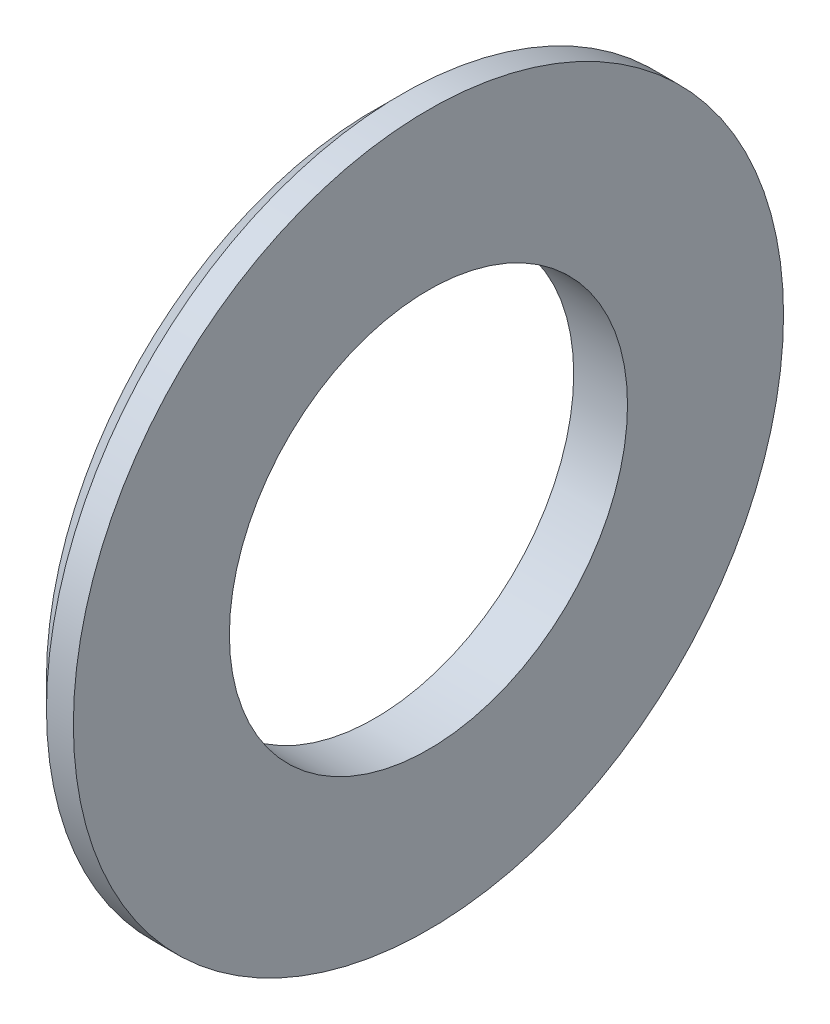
ISO-10303-21;
HEADER;
FILE_DESCRIPTION(('STEP AP214'),'2;1');
FILE_NAME('part.step','',(''),(''),'','','');
FILE_SCHEMA(('AUTOMOTIVE_DESIGN { 1 0 10303 214 1 1 1 1 }'));
ENDSEC;
DATA;
#1=APPLICATION_CONTEXT('core data for automotive mechanical design processes');
#2=APPLICATION_PROTOCOL_DEFINITION('international standard','automotive_design',2000,#1);
#3=PRODUCT_CONTEXT('',#1,'mechanical');
#4=PRODUCT('Part','Part','',(#3));
#5=PRODUCT_RELATED_PRODUCT_CATEGORY('part','',(#4));
#6=PRODUCT_DEFINITION_FORMATION('','',#4);
#7=PRODUCT_DEFINITION_CONTEXT('part definition',#1,'design');
#8=PRODUCT_DEFINITION('design','',#6,#7);
#9=PRODUCT_DEFINITION_SHAPE('','',#8);
#10=(LENGTH_UNIT() NAMED_UNIT(*) SI_UNIT(.MILLI.,.METRE.));
#11=(NAMED_UNIT(*) PLANE_ANGLE_UNIT() SI_UNIT($,.RADIAN.));
#12=(NAMED_UNIT(*) SI_UNIT($,.STERADIAN.) SOLID_ANGLE_UNIT());
#13=UNCERTAINTY_MEASURE_WITH_UNIT(LENGTH_MEASURE(1.E-05),#10,'distance_accuracy_value','');
#14=(GEOMETRIC_REPRESENTATION_CONTEXT(3) GLOBAL_UNCERTAINTY_ASSIGNED_CONTEXT((#13)) GLOBAL_UNIT_ASSIGNED_CONTEXT((#10,
#11,#12)) REPRESENTATION_CONTEXT('',''));
#15=CARTESIAN_POINT('',(0.,0.,0.));
#16=DIRECTION('',(0.,0.,1.));
#17=DIRECTION('',(1.,0.,0.));
#18=AXIS2_PLACEMENT_3D('',#15,#16,#17);
#19=CARTESIAN_POINT('',(-34.9249999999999,0.,0.));
#20=DIRECTION('',(-1.,0.,0.));
#21=DIRECTION('',(0.,0.,1.));
#22=AXIS2_PLACEMENT_3D('',#19,#20,#21);
#23=CYLINDRICAL_SURFACE('',#22,18.5);
#24=CARTESIAN_POINT('',(0.,0.,0.));
#25=DIRECTION('',(-1.,0.,0.));
#26=DIRECTION('',(0.,0.,1.));
#27=AXIS2_PLACEMENT_3D('',#24,#25,#26);
#28=CIRCLE('',#27,18.5);
#29=CARTESIAN_POINT('',(0.,0.,18.5));
#30=VERTEX_POINT('',#29);
#31=EDGE_CURVE('E10',#30,#30,#28,.T.);
#32=ORIENTED_EDGE('',*,*,#31,.F.);
#33=EDGE_LOOP('',(#32));
#34=FACE_BOUND('',#33,.T.);
#35=CARTESIAN_POINT('',(-5.,0.,0.));
#36=DIRECTION('',(-1.,0.,0.));
#37=DIRECTION('',(0.,0.,1.));
#38=AXIS2_PLACEMENT_3D('',#35,#36,#37);
#39=CIRCLE('',#38,18.5);
#40=CARTESIAN_POINT('',(-5.,0.,18.5));
#41=VERTEX_POINT('',#40);
#42=EDGE_CURVE('E50',#41,#41,#39,.T.);
#43=ORIENTED_EDGE('',*,*,#42,.T.);
#44=EDGE_LOOP('',(#43));
#45=FACE_BOUND('',#44,.T.);
#46=ADVANCED_FACE('F31',(#34,#45),#23,.F.);
#47=CARTESIAN_POINT('',(0.,18.5,0.));
#48=DIRECTION('',(-1.,0.,0.));
#49=DIRECTION('',(0.,0.,1.));
#50=AXIS2_PLACEMENT_3D('',#47,#48,#49);
#51=PLANE('',#50);
#52=CARTESIAN_POINT('',(0.,0.,0.));
#53=DIRECTION('',(-1.,0.,0.));
#54=DIRECTION('',(0.,0.,1.));
#55=AXIS2_PLACEMENT_3D('',#52,#53,#54);
#56=CIRCLE('',#55,33.);
#57=CARTESIAN_POINT('',(0.,0.,33.));
#58=VERTEX_POINT('',#57);
#59=EDGE_CURVE('E37',#58,#58,#56,.T.);
#60=ORIENTED_EDGE('',*,*,#59,.F.);
#61=EDGE_LOOP('',(#60));
#62=FACE_BOUND('',#61,.T.);
#63=ORIENTED_EDGE('',*,*,#31,.T.);
#64=EDGE_LOOP('',(#63));
#65=FACE_BOUND('',#64,.T.);
#66=ADVANCED_FACE('F69',(#62,#65),#51,.F.);
#67=CARTESIAN_POINT('',(-34.9249999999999,0.,0.));
#68=DIRECTION('',(-1.,0.,0.));
#69=DIRECTION('',(0.,0.,1.));
#70=AXIS2_PLACEMENT_3D('',#67,#68,#69);
#71=CYLINDRICAL_SURFACE('',#70,33.);
#72=CARTESIAN_POINT('',(-2.5,0.,0.));
#73=DIRECTION('',(-1.,0.,0.));
#74=DIRECTION('',(0.,0.,1.));
#75=AXIS2_PLACEMENT_3D('',#72,#73,#74);
#76=CIRCLE('',#75,33.);
#77=CARTESIAN_POINT('',(-2.5,0.,33.));
#78=VERTEX_POINT('',#77);
#79=EDGE_CURVE('E41',#78,#78,#76,.T.);
#80=ORIENTED_EDGE('',*,*,#79,.F.);
#81=EDGE_LOOP('',(#80));
#82=FACE_BOUND('',#81,.T.);
#83=ORIENTED_EDGE('',*,*,#59,.T.);
#84=EDGE_LOOP('',(#83));
#85=FACE_BOUND('',#84,.T.);
#86=ADVANCED_FACE('F63',(#82,#85),#71,.T.);
#87=CARTESIAN_POINT('',(-5.,0.,0.));
#88=DIRECTION('',(1.,0.,0.));
#89=DIRECTION('',(0.,0.,-1.));
#90=AXIS2_PLACEMENT_3D('',#87,#88,#89);
#91=CONICAL_SURFACE('',#90,30.5,0.785398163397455);
#92=ORIENTED_EDGE('',*,*,#79,.T.);
#93=EDGE_LOOP('',(#92));
#94=FACE_BOUND('',#93,.T.);
#95=CARTESIAN_POINT('',(-5.,0.,0.));
#96=DIRECTION('',(-1.,0.,0.));
#97=DIRECTION('',(0.,0.,1.));
#98=AXIS2_PLACEMENT_3D('',#95,#96,#97);
#99=CIRCLE('',#98,30.5);
#100=CARTESIAN_POINT('',(-5.,0.,30.5));
#101=VERTEX_POINT('',#100);
#102=EDGE_CURVE('E45',#101,#101,#99,.T.);
#103=ORIENTED_EDGE('',*,*,#102,.F.);
#104=EDGE_LOOP('',(#103));
#105=FACE_BOUND('',#104,.T.);
#106=ADVANCED_FACE('F58',(#94,#105),#91,.T.);
#107=CARTESIAN_POINT('',(-5.,30.5,0.));
#108=DIRECTION('',(1.,0.,0.));
#109=DIRECTION('',(0.,0.,-1.));
#110=AXIS2_PLACEMENT_3D('',#107,#108,#109);
#111=PLANE('',#110);
#112=ORIENTED_EDGE('',*,*,#42,.F.);
#113=EDGE_LOOP('',(#112));
#114=FACE_BOUND('',#113,.T.);
#115=ORIENTED_EDGE('',*,*,#102,.T.);
#116=EDGE_LOOP('',(#115));
#117=FACE_BOUND('',#116,.T.);
#118=ADVANCED_FACE('F55',(#114,#117),#111,.F.);
#119=CLOSED_SHELL('',(#46,#66,#86,#106,#118));
#120=MANIFOLD_SOLID_BREP('B2',#119);
#121=ADVANCED_BREP_SHAPE_REPRESENTATION('',(#18,#120),#14);
#122=SHAPE_DEFINITION_REPRESENTATION(#9,#121);
ENDSEC;
END-ISO-10303-21;
